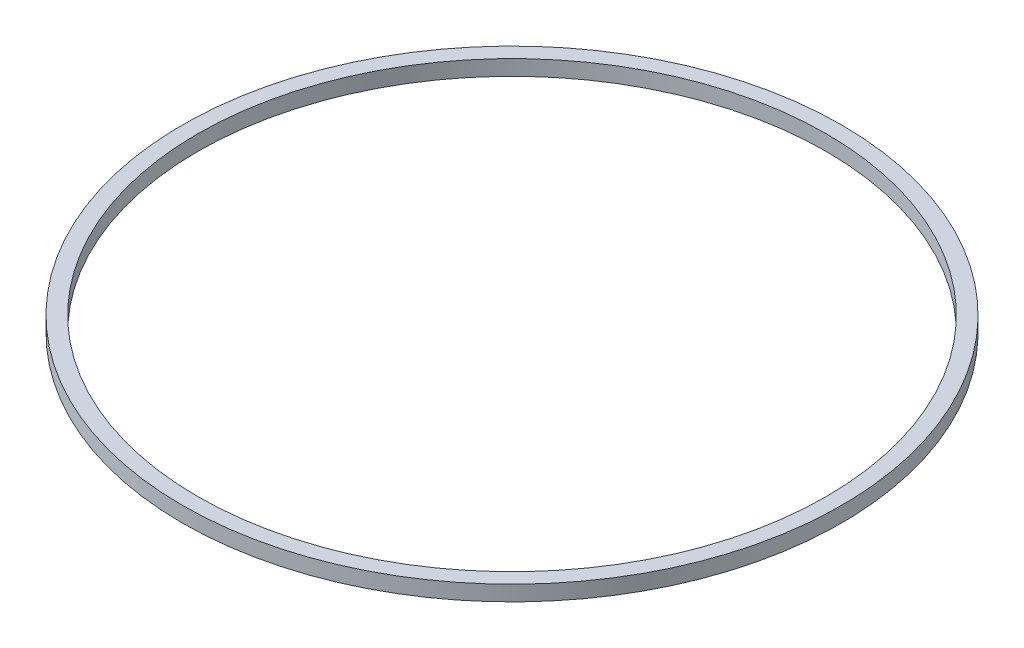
ISO-10303-21;
HEADER;
FILE_DESCRIPTION(('STEP AP214'),'2;1');
FILE_NAME('part.step','',(''),(''),'','','');
FILE_SCHEMA(('AUTOMOTIVE_DESIGN { 1 0 10303 214 1 1 1 1 }'));
ENDSEC;
DATA;
#1=APPLICATION_CONTEXT('core data for automotive mechanical design processes');
#2=APPLICATION_PROTOCOL_DEFINITION('international standard','automotive_design',2000,#1);
#3=PRODUCT_CONTEXT('',#1,'mechanical');
#4=PRODUCT('Part','Part','',(#3));
#5=PRODUCT_RELATED_PRODUCT_CATEGORY('part','',(#4));
#6=PRODUCT_DEFINITION_FORMATION('','',#4);
#7=PRODUCT_DEFINITION_CONTEXT('part definition',#1,'design');
#8=PRODUCT_DEFINITION('design','',#6,#7);
#9=PRODUCT_DEFINITION_SHAPE('','',#8);
#10=(LENGTH_UNIT() NAMED_UNIT(*) SI_UNIT(.MILLI.,.METRE.));
#11=(NAMED_UNIT(*) PLANE_ANGLE_UNIT() SI_UNIT($,.RADIAN.));
#12=(NAMED_UNIT(*) SI_UNIT($,.STERADIAN.) SOLID_ANGLE_UNIT());
#13=UNCERTAINTY_MEASURE_WITH_UNIT(LENGTH_MEASURE(1.E-05),#10,'distance_accuracy_value','');
#14=(GEOMETRIC_REPRESENTATION_CONTEXT(3) GLOBAL_UNCERTAINTY_ASSIGNED_CONTEXT((#13)) GLOBAL_UNIT_ASSIGNED_CONTEXT((#10,
#11,#12)) REPRESENTATION_CONTEXT('',''));
#15=CARTESIAN_POINT('',(0.,0.,0.));
#16=DIRECTION('',(0.,0.,1.));
#17=DIRECTION('',(1.,0.,0.));
#18=AXIS2_PLACEMENT_3D('',#15,#16,#17);
#19=CARTESIAN_POINT('',(0.,2.,0.));
#20=DIRECTION('',(0.,-1.,0.));
#21=DIRECTION('',(0.,0.,-1.));
#22=AXIS2_PLACEMENT_3D('',#19,#20,#21);
#23=PLANE('',#22);
#24=CARTESIAN_POINT('',(0.,2.,0.));
#25=DIRECTION('',(0.,-1.,0.));
#26=DIRECTION('',(0.,0.,-1.));
#27=AXIS2_PLACEMENT_3D('',#24,#25,#26);
#28=CIRCLE('',#27,41.);
#29=CARTESIAN_POINT('',(0.,2.,-41.));
#30=VERTEX_POINT('',#29);
#31=EDGE_CURVE('E26',#30,#30,#28,.T.);
#32=ORIENTED_EDGE('',*,*,#31,.T.);
#33=EDGE_LOOP('',(#32));
#34=FACE_BOUND('',#33,.T.);
#35=CARTESIAN_POINT('',(0.,2.,0.));
#36=DIRECTION('',(0.,-1.,0.));
#37=DIRECTION('',(0.,0.,-1.));
#38=AXIS2_PLACEMENT_3D('',#35,#36,#37);
#39=CIRCLE('',#38,43.);
#40=CARTESIAN_POINT('',(0.,2.,-43.));
#41=VERTEX_POINT('',#40);
#42=EDGE_CURVE('E17',#41,#41,#39,.T.);
#43=ORIENTED_EDGE('',*,*,#42,.F.);
#44=EDGE_LOOP('',(#43));
#45=FACE_BOUND('',#44,.T.);
#46=ADVANCED_FACE('F14',(#34,#45),#23,.F.);
#47=CARTESIAN_POINT('',(0.,2.1,0.));
#48=DIRECTION('',(0.,-1.,0.));
#49=DIRECTION('',(0.,0.,-1.));
#50=AXIS2_PLACEMENT_3D('',#47,#48,#49);
#51=CYLINDRICAL_SURFACE('',#50,43.);
#52=CARTESIAN_POINT('',(0.,0.,0.));
#53=DIRECTION('',(0.,-1.,0.));
#54=DIRECTION('',(0.,0.,-1.));
#55=AXIS2_PLACEMENT_3D('',#52,#53,#54);
#56=CIRCLE('',#55,43.);
#57=CARTESIAN_POINT('',(0.,0.,-43.));
#58=VERTEX_POINT('',#57);
#59=EDGE_CURVE('E21',#58,#58,#56,.T.);
#60=ORIENTED_EDGE('',*,*,#59,.F.);
#61=EDGE_LOOP('',(#60));
#62=FACE_BOUND('',#61,.T.);
#63=ORIENTED_EDGE('',*,*,#42,.T.);
#64=EDGE_LOOP('',(#63));
#65=FACE_BOUND('',#64,.T.);
#66=ADVANCED_FACE('F34',(#62,#65),#51,.T.);
#67=CARTESIAN_POINT('',(0.,2.1,0.));
#68=DIRECTION('',(0.,-1.,0.));
#69=DIRECTION('',(0.,0.,-1.));
#70=AXIS2_PLACEMENT_3D('',#67,#68,#69);
#71=CYLINDRICAL_SURFACE('',#70,41.);
#72=CARTESIAN_POINT('',(0.,0.,0.));
#73=DIRECTION('',(0.,-1.,0.));
#74=DIRECTION('',(0.,0.,-1.));
#75=AXIS2_PLACEMENT_3D('',#72,#73,#74);
#76=CIRCLE('',#75,41.);
#77=CARTESIAN_POINT('',(0.,0.,-41.));
#78=VERTEX_POINT('',#77);
#79=EDGE_CURVE('E10',#78,#78,#76,.F.);
#80=ORIENTED_EDGE('',*,*,#79,.F.);
#81=EDGE_LOOP('',(#80));
#82=FACE_BOUND('',#81,.T.);
#83=ORIENTED_EDGE('',*,*,#31,.F.);
#84=EDGE_LOOP('',(#83));
#85=FACE_BOUND('',#84,.T.);
#86=ADVANCED_FACE('F41',(#82,#85),#71,.F.);
#87=CARTESIAN_POINT('',(0.,0.,0.));
#88=DIRECTION('',(0.,-1.,0.));
#89=DIRECTION('',(0.,0.,-1.));
#90=AXIS2_PLACEMENT_3D('',#87,#88,#89);
#91=PLANE('',#90);
#92=ORIENTED_EDGE('',*,*,#79,.T.);
#93=EDGE_LOOP('',(#92));
#94=FACE_BOUND('',#93,.T.);
#95=ORIENTED_EDGE('',*,*,#59,.T.);
#96=EDGE_LOOP('',(#95));
#97=FACE_BOUND('',#96,.T.);
#98=ADVANCED_FACE('F43',(#94,#97),#91,.T.);
#99=CLOSED_SHELL('',(#46,#66,#86,#98));
#100=MANIFOLD_SOLID_BREP('B1',#99);
#101=ADVANCED_BREP_SHAPE_REPRESENTATION('',(#18,#100),#14);
#102=SHAPE_DEFINITION_REPRESENTATION(#9,#101);
ENDSEC;
END-ISO-10303-21;
